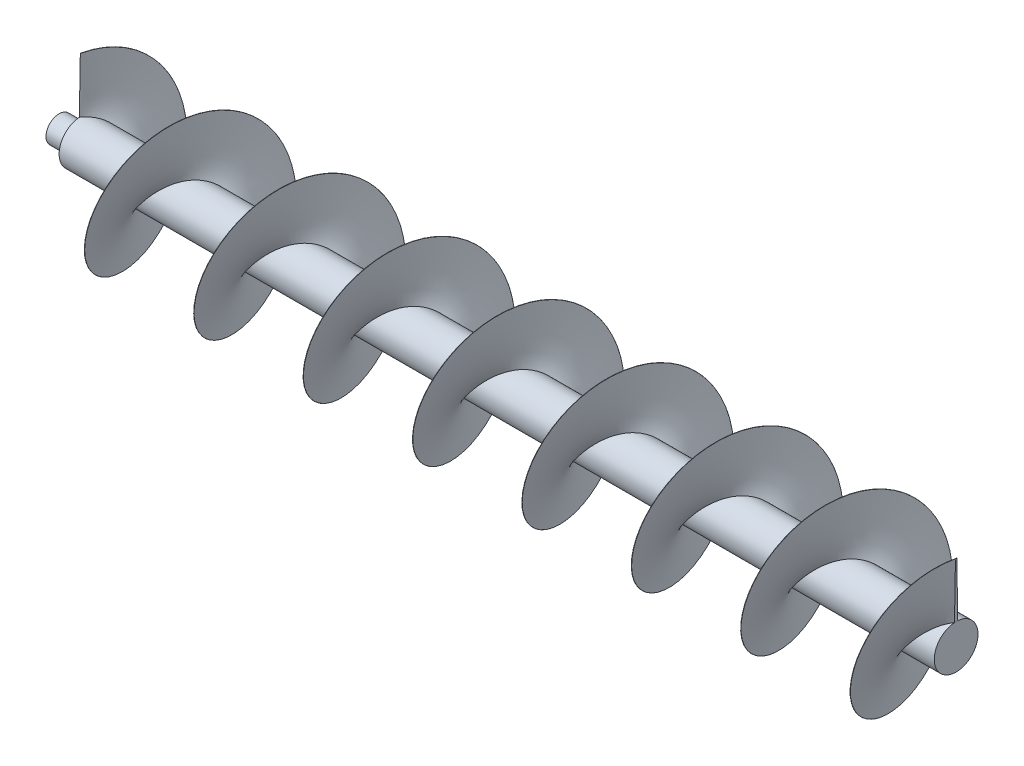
from build123d import *

# Parameters (mm, degrees)
SKETCH1_R                = 30
BOSS_EXTRUDE1_DEPTH      = 450
BOSS_EXTRUDE2_START      = 1600
SKETCH1_3_R              = 30
BOSS_EXTRUDE2_DEPTH      = 1600
BOSS_EXTRUDE3_DEPTH      = 1600
BOSS_EXTRUDE3_DEPTH_BACK = 400
SKETCH1_4_R              = 50
SKETCH1_4_R_2            = 40
BOSS_EXTRUDE4_START      = 1600
SKETCH1_5_R              = 40
SKETCH1_5_R_2            = 30
BOSS_EXTRUDE4_DEPTH      = 10
BOSS_EXTRUDE5_START      = -400
SKETCH1_6_R              = 40
SKETCH1_6_R_2            = 30
BOSS_EXTRUDE5_DEPTH      = 10
SWEEP1_PITCH             = 250
SWEEP1_HEIGHT            = 2000
SWEEP1_RADIUS            = 175
SWEEP1_START_ANGLE       = -90


with BuildPart() as part:
    # Sketch1 → Boss-Extrude1 (new body)
    with BuildSketch(Plane(origin=(0, 0, 0), x_dir=(0, 0, -1), z_dir=(1, 0, 0))):
        Circle(SKETCH1_R)
    extrude(amount=-BOSS_EXTRUDE1_DEPTH)

    # Sketch1_3 → Boss-Extrude2 (add)
    with BuildSketch(Plane(origin=(0, 0, 0), x_dir=(0, 0, -1), z_dir=(1, 0, 0)).offset(BOSS_EXTRUDE2_START)):
        Circle(SKETCH1_3_R)
    extrude(amount=-BOSS_EXTRUDE2_DEPTH)



with BuildPart() as body_2:
    # Sketch1_4 → Boss-Extrude3 (new, two sides: drawn at the far end of the back side and taken through both)
    with BuildSketch(Plane(origin=(0, 0, 0), x_dir=(0, 0, -1), z_dir=(1, 0, 0)).offset(-BOSS_EXTRUDE3_DEPTH_BACK)):
        Circle(SKETCH1_4_R)
        Circle(SKETCH1_4_R_2, mode=Mode.SUBTRACT)
    extrude(amount=BOSS_EXTRUDE3_DEPTH + BOSS_EXTRUDE3_DEPTH_BACK)


with BuildPart() as part_1:
    add(part.part)

    add(body_2.part)  # Boss-Extrude4 merges body 2
    # Sketch1_5 → Boss-Extrude4 (add)
    with BuildSketch(Plane(origin=(0, 0, 0), x_dir=(0, 0, -1), z_dir=(1, 0, 0)).offset(BOSS_EXTRUDE4_START)):
        Circle(SKETCH1_5_R)
        Circle(SKETCH1_5_R_2, mode=Mode.SUBTRACT)
    extrude(amount=-BOSS_EXTRUDE4_DEPTH)

    # Sketch1_6 → Boss-Extrude5 (add)
    with BuildSketch(Plane(origin=(0, 0, 0), x_dir=(0, 0, -1), z_dir=(1, 0, 0)).offset(BOSS_EXTRUDE5_START)):
        Circle(SKETCH1_6_R)
        Circle(SKETCH1_6_R_2, mode=Mode.SUBTRACT)
    extrude(amount=BOSS_EXTRUDE5_DEPTH)


with BuildPart() as body_2_2:
    # Sweep1: sweep along a helix
    with BuildLine() as sweep1_path:
        add(Helix(SWEEP1_PITCH, SWEEP1_HEIGHT, SWEEP1_RADIUS, center=(1600, 0, 0), direction=(-1, 0, 0), lefthand=True, mode=Mode.PRIVATE).rotate(Axis((1600, 0, 0), (-1, 0, 0)), SWEEP1_START_ANGLE))
    # Sketch3 → Sweep1 (sweep)
    with BuildSketch(Plane(origin=(1600, 0, 0), x_dir=(0, 0, -1), z_dir=(1, 0, 0))):
        with BuildLine():
            Line((-1.527143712, 174.993336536), (-3.75, 49.859176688))
            ThreePointArc((-3.75, 49.859176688), (0, 50), (3.75, 49.859176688))
            Line((3.75, 49.859176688), (1.527143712, 174.993336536))
            ThreePointArc((1.527143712, 174.993336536), (0, 175), (-1.527143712, 174.993336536))
        make_face()
    sweep(path=sweep1_path.line, is_frenet=True)


solid = Compound([part_1.part, body_2_2.part])
